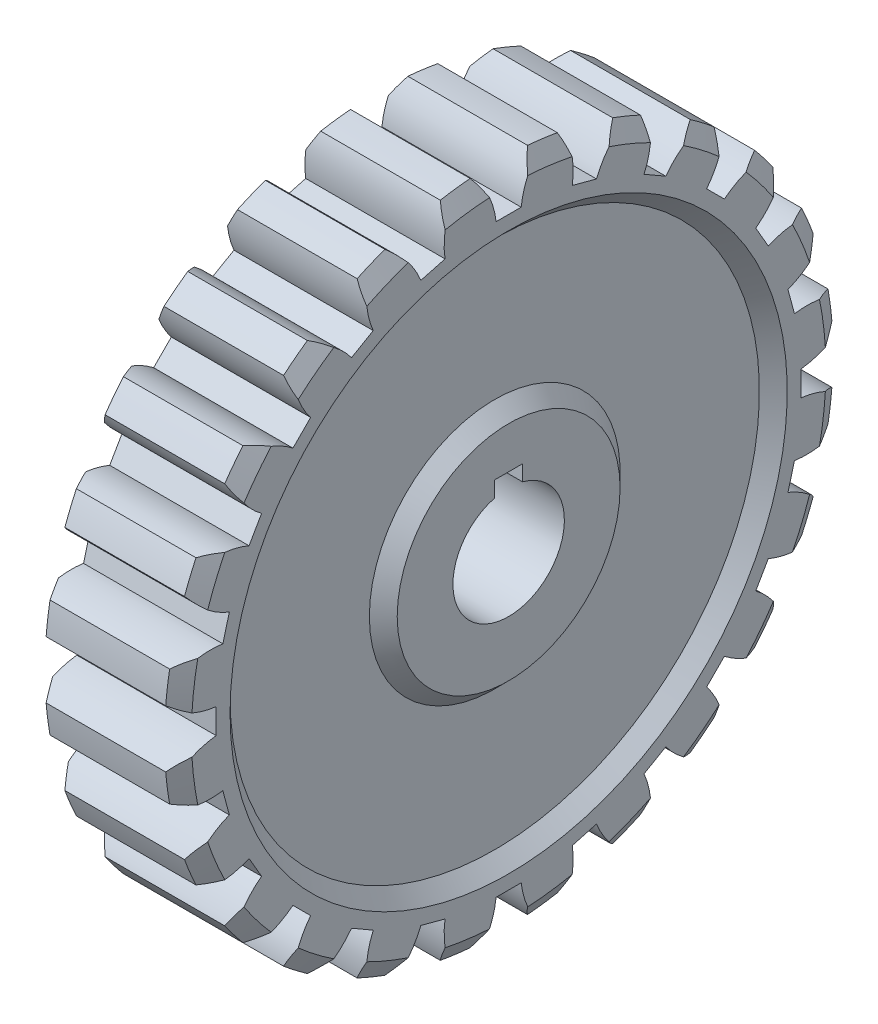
from build123d import *

# Parameters (mm, degrees)
EXTRUDE1_DEPTH    = 113.342968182
CIRPATTERN1_COUNT = 24
EXTRUDE2_DEPTH    = 112.961539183


with BuildPart() as part:
    # Sketch1 → Revolve2 (revolve)
    with BuildSketch(Plane.XY, mode=Mode.PRIVATE) as revolve2_sk:
        Polygon((-15.875, 12.7), (15.875, 12.7), (15.875, 25.4), (12.7, 28.575), (12.7, 60.325), (15.875, 63.5), (15.875, 72.311435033), (13.62993597, 76.2), (-13.62993597, 76.2), (-15.875, 72.311435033), (-15.875, 63.5), (-12.7, 60.325), (-12.7, 28.575), (-15.875, 25.4), align=None)
    revolve(revolve2_sk.sketch.rotate(Axis((0, 0, 0), (1, 0, 0)), 90), axis=Axis((0, 0, 0), (1, 0, 0)))

    # Sketch4 → Extrude1 (cut, through all)
    with BuildSketch(Plane(origin=(15.875, 0, 0), x_dir=(0, 0, -1), z_dir=(1, 0, 0))):
        with BuildLine():
            Line((-2.8575, 66.675), (2.8575, 66.675))
            ThreePointArc((2.8575, 66.675), (4.084797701, 71.541608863), (6.5405, 75.91878463))
            ThreePointArc((6.5405, 75.91878463), (0, 76.2), (-6.5405, 75.91878463))
            ThreePointArc((-6.5405, 75.91878463), (-4.084797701, 71.541608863), (-2.8575, 66.675))
        make_face()
    extrude1 = extrude(amount=-EXTRUDE1_DEPTH, mode=Mode.SUBTRACT)

    # CirPattern1: Extrude1 ×24 about axis
    cirpattern1_axis = Axis((0, 0, 0), (1, 0, 0))
    for i in range(1, CIRPATTERN1_COUNT):
        add(extrude1.rotate(cirpattern1_axis, i * 360 / CIRPATTERN1_COUNT), mode=Mode.SUBTRACT)

    # Sketch5 → Extrude2 (cut, through all)
    with BuildSketch(Plane(origin=(15.875, 0, 0), x_dir=(0, 0, -1), z_dir=(1, 0, 0))):
        with BuildLine():
            Line((-3.175, 15.875), (3.175, 15.875))
            Line((3.175, 15.875), (3.175, 12.296722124))
            ThreePointArc((3.175, 12.296722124), (0, 12.7), (-3.175, 12.296722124))
            Line((-3.175, 12.296722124), (-3.175, 15.875))
        make_face()
    extrude(amount=-EXTRUDE2_DEPTH, mode=Mode.SUBTRACT)


solid = part.part
